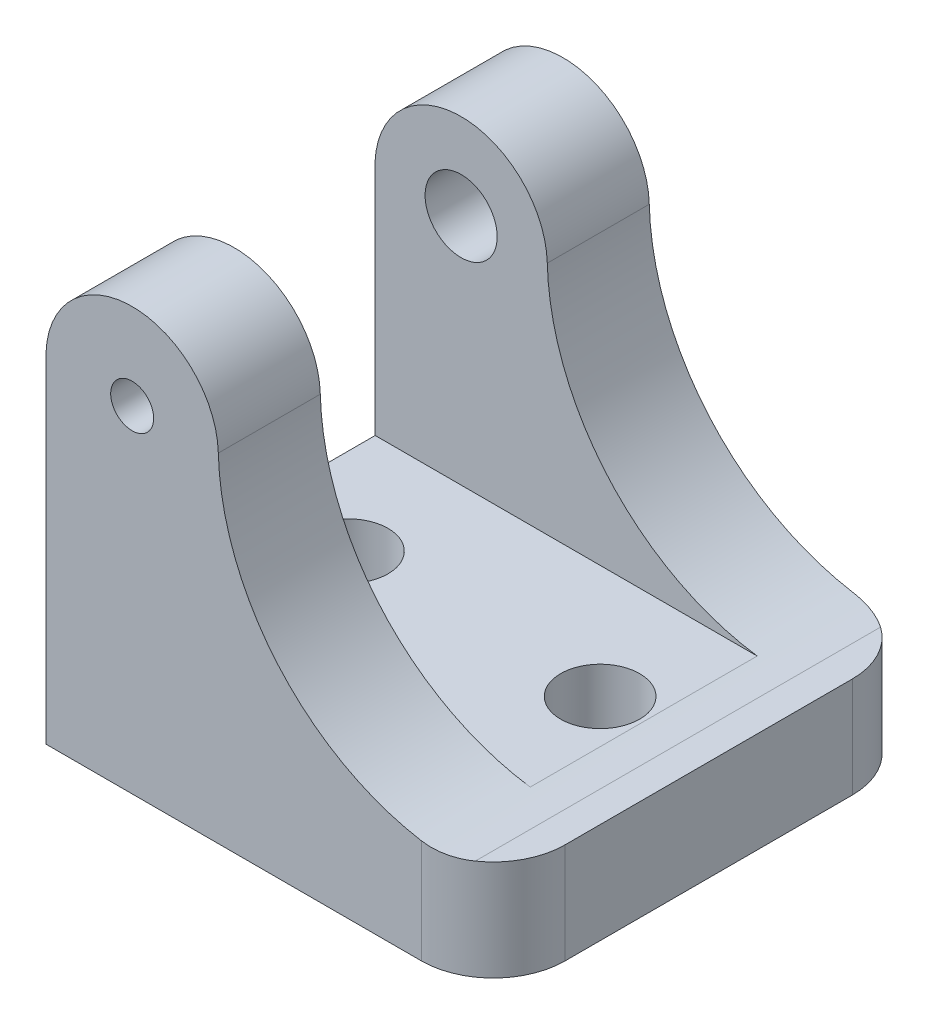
from build123d import *

# Parameters (mm, degrees)
BOSS_EXTRUDE1_DEPTH                              = 38.1
CUT_EXTRUDE1_DEPTH                               = 67.382149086
CUT_EXTRUDE1_DEPTH_BACK                          = 67.382149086
SKETCH3_W                                        = 20.066
SKETCH3_H                                        = 28.2194
F_10_24_TAPPED_HOLE1_D                           = 3.7973
F_10_24_TAPPED_HOLE1_DEPTH                       = 12.954
F_10_24_TAPPED_HOLE1_TIP                         = 1.140824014
CBORE_FOR_1_4_SOCKET_SHOULDER_SCREW1_D           = 6.3754
CBORE_FOR_1_4_SOCKET_SHOULDER_SCREW1_DEPTH       = 9.017
CBORE_FOR_1_4_SOCKET_SHOULDER_SCREW1_CBORE_D     = 10.2616
CBORE_FOR_1_4_SOCKET_SHOULDER_SCREW1_CBORE_DEPTH = 3.8862
SKETCH13_R                                       = 3.4925
CUT_EXTRUDE2_DEPTH                               = 57.885100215
FILLET1_R                                        = 6.35


with BuildPart() as part:
    # Sketch1 → Boss-Extrude1 (new body)
    with BuildSketch(Plane.XY):
        with BuildLine():
            Line((-19.7612, 0), (19.7612, 0))
            Line((19.7612, 0), (19.7612, 8.89))
            Line((19.7612, 8.89), (17.037205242, 8.89))
            ThreePointArc((17.037205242, 8.89), (1.975351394, 15.011688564), (-4.545142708, 29.905233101))
            ThreePointArc((-4.545142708, 29.905233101), (-12.548269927, 37.3126), (-19.7612, 29.1338))
            Line((-19.7612, 29.1338), (-19.7612, 0))
        make_face()
    extrude(amount=-BOSS_EXTRUDE1_DEPTH)

    # Sketch3 → Cut-Extrude1 (cut, two sides: drawn at the far end of the back side and taken through both)
    with BuildSketch(Plane.ZY.offset(19.7612).offset(-CUT_EXTRUDE1_DEPTH_BACK)):
        with Locations((-19.05, 23.212674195)):
            Rectangle(SKETCH3_W, SKETCH3_H)
    extrude(amount=CUT_EXTRUDE1_DEPTH + CUT_EXTRUDE1_DEPTH_BACK, mode=Mode.SUBTRACT)

    # 10-24 Tapped Hole1
    with Locations(Plane.XY):
        with Locations((-12.162441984, 29.702374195)):
            Hole(F_10_24_TAPPED_HOLE1_D / 2, depth=F_10_24_TAPPED_HOLE1_DEPTH)
            with Locations((0, 0, -(F_10_24_TAPPED_HOLE1_DEPTH + F_10_24_TAPPED_HOLE1_TIP / 2))):  # 118° drill point
                Cone(0, F_10_24_TAPPED_HOLE1_D / 2, F_10_24_TAPPED_HOLE1_TIP, mode=Mode.SUBTRACT)

    # CBORE for 1_4 Socket Shoulder Screw1
    with Locations(Plane(origin=(0, 0, -38.1), x_dir=(-1, 0, 0), z_dir=(0, 0, -1))):
        with Locations((12.162441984, 29.702374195)):
            CounterBoreHole(CBORE_FOR_1_4_SOCKET_SHOULDER_SCREW1_D / 2, CBORE_FOR_1_4_SOCKET_SHOULDER_SCREW1_CBORE_D / 2, CBORE_FOR_1_4_SOCKET_SHOULDER_SCREW1_CBORE_DEPTH, depth=CBORE_FOR_1_4_SOCKET_SHOULDER_SCREW1_DEPTH)

    # Sketch13 → Cut-Extrude2 (cut, through all)
    with BuildSketch(Plane.XZ):
        with Locations((-12.0904, -19.05)):
            Circle(SKETCH13_R)
        with Locations((10.16, -19.05)):
            Circle(SKETCH13_R)
    extrude(amount=-CUT_EXTRUDE2_DEPTH, mode=Mode.SUBTRACT)

    # Fillet1
    fillet1_edges = [part.edges().sort_by_distance(p)[0] for p in [
        (19.7612, 4.445, -38.1),
        (19.7612, 4.445, 0),
    ]]
    fillet(fillet1_edges, radius=FILLET1_R)


solid = part.part
